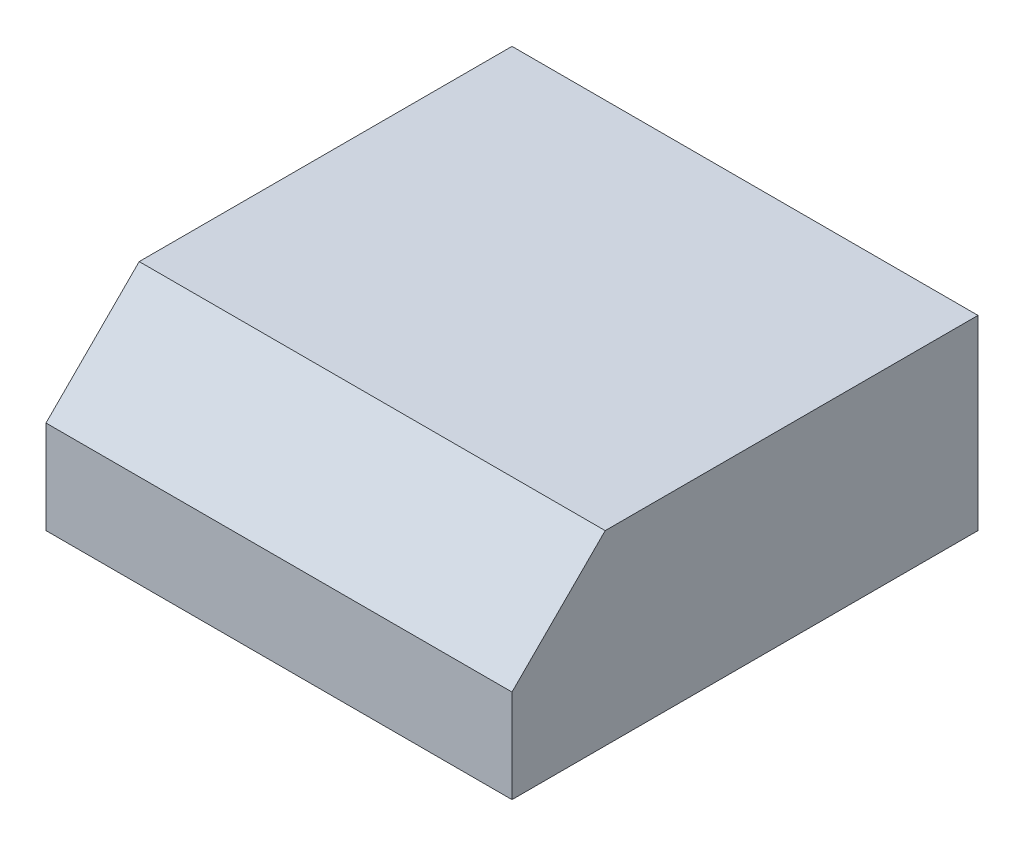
ISO-10303-21;
HEADER;
FILE_DESCRIPTION(('STEP AP214'),'2;1');
FILE_NAME('part.step','',(''),(''),'','','');
FILE_SCHEMA(('AUTOMOTIVE_DESIGN { 1 0 10303 214 1 1 1 1 }'));
ENDSEC;
DATA;
#1=APPLICATION_CONTEXT('core data for automotive mechanical design processes');
#2=APPLICATION_PROTOCOL_DEFINITION('international standard','automotive_design',2000,#1);
#3=PRODUCT_CONTEXT('',#1,'mechanical');
#4=PRODUCT('Part','Part','',(#3));
#5=PRODUCT_RELATED_PRODUCT_CATEGORY('part','',(#4));
#6=PRODUCT_DEFINITION_FORMATION('','',#4);
#7=PRODUCT_DEFINITION_CONTEXT('part definition',#1,'design');
#8=PRODUCT_DEFINITION('design','',#6,#7);
#9=PRODUCT_DEFINITION_SHAPE('','',#8);
#10=(LENGTH_UNIT() NAMED_UNIT(*) SI_UNIT(.MILLI.,.METRE.));
#11=(NAMED_UNIT(*) PLANE_ANGLE_UNIT() SI_UNIT($,.RADIAN.));
#12=(NAMED_UNIT(*) SI_UNIT($,.STERADIAN.) SOLID_ANGLE_UNIT());
#13=UNCERTAINTY_MEASURE_WITH_UNIT(LENGTH_MEASURE(1.E-05),#10,'distance_accuracy_value','');
#14=(GEOMETRIC_REPRESENTATION_CONTEXT(3) GLOBAL_UNCERTAINTY_ASSIGNED_CONTEXT((#13)) GLOBAL_UNIT_ASSIGNED_CONTEXT((#10,
#11,#12)) REPRESENTATION_CONTEXT('',''));
#15=CARTESIAN_POINT('',(0.,0.,0.));
#16=DIRECTION('',(0.,0.,1.));
#17=DIRECTION('',(1.,0.,0.));
#18=AXIS2_PLACEMENT_3D('',#15,#16,#17);
#19=CARTESIAN_POINT('',(-25.,20.,-25.));
#20=DIRECTION('',(0.,1.,0.));
#21=DIRECTION('',(0.,0.,1.));
#22=AXIS2_PLACEMENT_3D('',#19,#20,#21);
#23=PLANE('',#22);
#24=DIRECTION('',(0.,0.,1.));
#25=VECTOR('',#24,1.);
#26=CARTESIAN_POINT('',(-25.,20.,-25.));
#27=LINE('',#26,#25);
#28=CARTESIAN_POINT('',(-25.,20.,-25.));
#29=VERTEX_POINT('',#28);
#30=CARTESIAN_POINT('',(-25.,20.,15.));
#31=VERTEX_POINT('',#30);
#32=EDGE_CURVE('E103',#29,#31,#27,.T.);
#33=ORIENTED_EDGE('',*,*,#32,.T.);
#34=DIRECTION('',(1.,0.,0.));
#35=VECTOR('',#34,1.);
#36=CARTESIAN_POINT('',(25.,20.,15.));
#37=LINE('',#36,#35);
#38=CARTESIAN_POINT('',(25.,20.,15.));
#39=VERTEX_POINT('',#38);
#40=EDGE_CURVE('E83',#31,#39,#37,.T.);
#41=ORIENTED_EDGE('',*,*,#40,.T.);
#42=DIRECTION('',(0.,0.,-1.));
#43=VECTOR('',#42,1.);
#44=CARTESIAN_POINT('',(25.,20.,-25.));
#45=LINE('',#44,#43);
#46=CARTESIAN_POINT('',(25.,20.,-25.));
#47=VERTEX_POINT('',#46);
#48=EDGE_CURVE('E106',#39,#47,#45,.T.);
#49=ORIENTED_EDGE('',*,*,#48,.T.);
#50=DIRECTION('',(-1.,0.,0.));
#51=VECTOR('',#50,1.);
#52=CARTESIAN_POINT('',(-25.,20.,-25.));
#53=LINE('',#52,#51);
#54=EDGE_CURVE('E108',#47,#29,#53,.T.);
#55=ORIENTED_EDGE('',*,*,#54,.T.);
#56=EDGE_LOOP('',(#33,#41,#49,#55));
#57=FACE_BOUND('',#56,.T.);
#58=ADVANCED_FACE('F32',(#57),#23,.T.);
#59=CARTESIAN_POINT('',(-25.,20.,-25.));
#60=DIRECTION('',(1.,0.,0.));
#61=DIRECTION('',(0.,0.,-1.));
#62=AXIS2_PLACEMENT_3D('',#59,#60,#61);
#63=PLANE('',#62);
#64=DIRECTION('',(0.,-1.,0.));
#65=VECTOR('',#64,1.);
#66=CARTESIAN_POINT('',(-25.,20.,25.));
#67=LINE('',#66,#65);
#68=CARTESIAN_POINT('',(-25.,9.99999999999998,25.));
#69=VERTEX_POINT('',#68);
#70=CARTESIAN_POINT('',(-25.,0.,25.));
#71=VERTEX_POINT('',#70);
#72=EDGE_CURVE('E75',#69,#71,#67,.T.);
#73=ORIENTED_EDGE('',*,*,#72,.F.);
#74=DIRECTION('',(0.,0.707106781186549,-0.707106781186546));
#75=VECTOR('',#74,1.);
#76=CARTESIAN_POINT('',(-25.,20.,15.));
#77=LINE('',#76,#75);
#78=EDGE_CURVE('E11',#69,#31,#77,.T.);
#79=ORIENTED_EDGE('',*,*,#78,.T.);
#80=ORIENTED_EDGE('',*,*,#32,.F.);
#81=DIRECTION('',(0.,-1.,0.));
#82=VECTOR('',#81,1.);
#83=CARTESIAN_POINT('',(-25.,20.,-25.));
#84=LINE('',#83,#82);
#85=CARTESIAN_POINT('',(-25.,0.,-25.));
#86=VERTEX_POINT('',#85);
#87=EDGE_CURVE('E97',#29,#86,#84,.T.);
#88=ORIENTED_EDGE('',*,*,#87,.T.);
#89=DIRECTION('',(0.,0.,1.));
#90=VECTOR('',#89,1.);
#91=CARTESIAN_POINT('',(-25.,0.,-25.));
#92=LINE('',#91,#90);
#93=EDGE_CURVE('E90',#86,#71,#92,.T.);
#94=ORIENTED_EDGE('',*,*,#93,.T.);
#95=EDGE_LOOP('',(#73,#79,#80,#88,#94));
#96=FACE_BOUND('',#95,.T.);
#97=ADVANCED_FACE('F94',(#96),#63,.F.);
#98=CARTESIAN_POINT('',(-25.,20.,25.));
#99=DIRECTION('',(0.,0.,-1.));
#100=DIRECTION('',(-1.,0.,0.));
#101=AXIS2_PLACEMENT_3D('',#98,#99,#100);
#102=PLANE('',#101);
#103=DIRECTION('',(0.,-1.,0.));
#104=VECTOR('',#103,1.);
#105=CARTESIAN_POINT('',(25.,20.,25.));
#106=LINE('',#105,#104);
#107=CARTESIAN_POINT('',(25.,9.99999999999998,25.));
#108=VERTEX_POINT('',#107);
#109=CARTESIAN_POINT('',(25.,0.,25.));
#110=VERTEX_POINT('',#109);
#111=EDGE_CURVE('E84',#108,#110,#106,.T.);
#112=ORIENTED_EDGE('',*,*,#111,.F.);
#113=DIRECTION('',(-1.,0.,0.));
#114=VECTOR('',#113,1.);
#115=CARTESIAN_POINT('',(-25.,9.99999999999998,25.));
#116=LINE('',#115,#114);
#117=EDGE_CURVE('E40',#108,#69,#116,.T.);
#118=ORIENTED_EDGE('',*,*,#117,.T.);
#119=ORIENTED_EDGE('',*,*,#72,.T.);
#120=DIRECTION('',(1.,0.,0.));
#121=VECTOR('',#120,1.);
#122=CARTESIAN_POINT('',(-25.,0.,25.));
#123=LINE('',#122,#121);
#124=EDGE_CURVE('E78',#71,#110,#123,.T.);
#125=ORIENTED_EDGE('',*,*,#124,.T.);
#126=EDGE_LOOP('',(#112,#118,#119,#125));
#127=FACE_BOUND('',#126,.T.);
#128=ADVANCED_FACE('F77',(#127),#102,.F.);
#129=CARTESIAN_POINT('',(25.,20.,-25.));
#130=DIRECTION('',(-1.,0.,0.));
#131=DIRECTION('',(0.,0.,1.));
#132=AXIS2_PLACEMENT_3D('',#129,#130,#131);
#133=PLANE('',#132);
#134=ORIENTED_EDGE('',*,*,#48,.F.);
#135=DIRECTION('',(0.,-0.707106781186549,0.707106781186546));
#136=VECTOR('',#135,1.);
#137=CARTESIAN_POINT('',(25.,20.,15.));
#138=LINE('',#137,#136);
#139=EDGE_CURVE('E54',#39,#108,#138,.T.);
#140=ORIENTED_EDGE('',*,*,#139,.T.);
#141=ORIENTED_EDGE('',*,*,#111,.T.);
#142=DIRECTION('',(0.,0.,-1.));
#143=VECTOR('',#142,1.);
#144=CARTESIAN_POINT('',(25.,0.,-25.));
#145=LINE('',#144,#143);
#146=CARTESIAN_POINT('',(25.,0.,-25.));
#147=VERTEX_POINT('',#146);
#148=EDGE_CURVE('E91',#110,#147,#145,.T.);
#149=ORIENTED_EDGE('',*,*,#148,.T.);
#150=DIRECTION('',(0.,-1.,0.));
#151=VECTOR('',#150,1.);
#152=CARTESIAN_POINT('',(25.,20.,-25.));
#153=LINE('',#152,#151);
#154=EDGE_CURVE('E111',#47,#147,#153,.T.);
#155=ORIENTED_EDGE('',*,*,#154,.F.);
#156=EDGE_LOOP('',(#134,#140,#141,#149,#155));
#157=FACE_BOUND('',#156,.T.);
#158=ADVANCED_FACE('F121',(#157),#133,.F.);
#159=CARTESIAN_POINT('',(-25.,20.,-25.));
#160=DIRECTION('',(0.,0.,1.));
#161=DIRECTION('',(1.,0.,0.));
#162=AXIS2_PLACEMENT_3D('',#159,#160,#161);
#163=PLANE('',#162);
#164=DIRECTION('',(-1.,0.,0.));
#165=VECTOR('',#164,1.);
#166=CARTESIAN_POINT('',(-25.,0.,-25.));
#167=LINE('',#166,#165);
#168=EDGE_CURVE('E101',#147,#86,#167,.T.);
#169=ORIENTED_EDGE('',*,*,#168,.T.);
#170=ORIENTED_EDGE('',*,*,#87,.F.);
#171=ORIENTED_EDGE('',*,*,#54,.F.);
#172=ORIENTED_EDGE('',*,*,#154,.T.);
#173=EDGE_LOOP('',(#169,#170,#171,#172));
#174=FACE_BOUND('',#173,.T.);
#175=ADVANCED_FACE('F124',(#174),#163,.F.);
#176=CARTESIAN_POINT('',(-25.,0.,-25.));
#177=DIRECTION('',(0.,1.,0.));
#178=DIRECTION('',(0.,0.,1.));
#179=AXIS2_PLACEMENT_3D('',#176,#177,#178);
#180=PLANE('',#179);
#181=ORIENTED_EDGE('',*,*,#93,.F.);
#182=ORIENTED_EDGE('',*,*,#168,.F.);
#183=ORIENTED_EDGE('',*,*,#148,.F.);
#184=ORIENTED_EDGE('',*,*,#124,.F.);
#185=EDGE_LOOP('',(#181,#182,#183,#184));
#186=FACE_BOUND('',#185,.T.);
#187=ADVANCED_FACE('F88',(#186),#180,.F.);
#188=CARTESIAN_POINT('',(-25.,20.,15.));
#189=DIRECTION('',(0.,0.707106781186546,0.707106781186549));
#190=DIRECTION('',(0.,-0.707106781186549,0.707106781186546));
#191=AXIS2_PLACEMENT_3D('',#188,#189,#190);
#192=PLANE('',#191);
#193=ORIENTED_EDGE('',*,*,#78,.F.);
#194=ORIENTED_EDGE('',*,*,#117,.F.);
#195=ORIENTED_EDGE('',*,*,#139,.F.);
#196=ORIENTED_EDGE('',*,*,#40,.F.);
#197=EDGE_LOOP('',(#193,#194,#195,#196));
#198=FACE_BOUND('',#197,.T.);
#199=ADVANCED_FACE('F34',(#198),#192,.T.);
#200=CLOSED_SHELL('',(#58,#97,#128,#158,#175,#187,#199));
#201=MANIFOLD_SOLID_BREP('B2',#200);
#202=ADVANCED_BREP_SHAPE_REPRESENTATION('',(#18,#201),#14);
#203=SHAPE_DEFINITION_REPRESENTATION(#9,#202);
ENDSEC;
END-ISO-10303-21;
